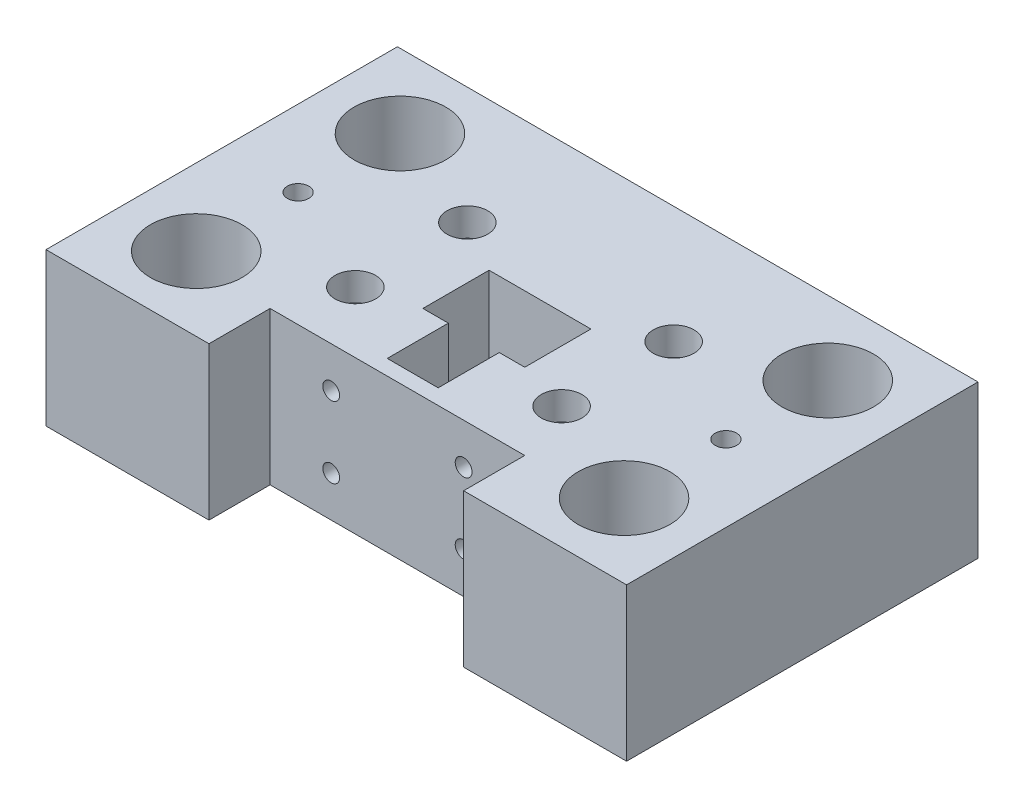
ISO-10303-21;
HEADER;
FILE_DESCRIPTION(('STEP AP214'),'2;1');
FILE_NAME('part.step','',(''),(''),'','','');
FILE_SCHEMA(('AUTOMOTIVE_DESIGN { 1 0 10303 214 1 1 1 1 }'));
ENDSEC;
DATA;
#1=APPLICATION_CONTEXT('core data for automotive mechanical design processes');
#2=APPLICATION_PROTOCOL_DEFINITION('international standard','automotive_design',2000,#1);
#3=PRODUCT_CONTEXT('',#1,'mechanical');
#4=PRODUCT('Part','Part','',(#3));
#5=PRODUCT_RELATED_PRODUCT_CATEGORY('part','',(#4));
#6=PRODUCT_DEFINITION_FORMATION('','',#4);
#7=PRODUCT_DEFINITION_CONTEXT('part definition',#1,'design');
#8=PRODUCT_DEFINITION('design','',#6,#7);
#9=PRODUCT_DEFINITION_SHAPE('','',#8);
#10=(LENGTH_UNIT() NAMED_UNIT(*) SI_UNIT(.MILLI.,.METRE.));
#11=(NAMED_UNIT(*) PLANE_ANGLE_UNIT() SI_UNIT($,.RADIAN.));
#12=(NAMED_UNIT(*) SI_UNIT($,.STERADIAN.) SOLID_ANGLE_UNIT());
#13=UNCERTAINTY_MEASURE_WITH_UNIT(LENGTH_MEASURE(1.E-05),#10,'distance_accuracy_value','');
#14=(GEOMETRIC_REPRESENTATION_CONTEXT(3) GLOBAL_UNCERTAINTY_ASSIGNED_CONTEXT((#13)) GLOBAL_UNIT_ASSIGNED_CONTEXT((#10,
#11,#12)) REPRESENTATION_CONTEXT('',''));
#15=CARTESIAN_POINT('',(0.,0.,0.));
#16=DIRECTION('',(0.,0.,1.));
#17=DIRECTION('',(1.,0.,0.));
#18=AXIS2_PLACEMENT_3D('',#15,#16,#17);
#19=CARTESIAN_POINT('',(36.7500000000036,-39.,23.0120402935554));
#20=DIRECTION('',(0.,1.,0.));
#21=DIRECTION('',(0.,0.,1.));
#22=AXIS2_PLACEMENT_3D('',#19,#20,#21);
#23=CYLINDRICAL_SURFACE('',#22,2.5);
#24=CARTESIAN_POINT('',(36.7500000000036,0.,23.0120402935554));
#25=DIRECTION('',(0.,1.,0.));
#26=DIRECTION('',(0.,0.,1.));
#27=AXIS2_PLACEMENT_3D('',#24,#25,#26);
#28=CIRCLE('',#27,2.5);
#29=CARTESIAN_POINT('',(36.7500000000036,0.,25.5120402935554));
#30=VERTEX_POINT('',#29);
#31=EDGE_CURVE('E208',#30,#30,#28,.T.);
#32=ORIENTED_EDGE('',*,*,#31,.F.);
#33=EDGE_LOOP('',(#32));
#34=FACE_BOUND('',#33,.T.);
#35=CARTESIAN_POINT('',(36.7500000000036,24.5,23.0120402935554));
#36=DIRECTION('',(0.,1.,0.));
#37=DIRECTION('',(0.,0.,1.));
#38=AXIS2_PLACEMENT_3D('',#35,#36,#37);
#39=CIRCLE('',#38,2.5);
#40=CARTESIAN_POINT('',(36.7500000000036,24.5,25.5120402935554));
#41=VERTEX_POINT('',#40);
#42=EDGE_CURVE('E37',#41,#41,#39,.F.);
#43=ORIENTED_EDGE('',*,*,#42,.F.);
#44=EDGE_LOOP('',(#43));
#45=FACE_BOUND('',#44,.T.);
#46=ADVANCED_FACE('F33',(#34,#45),#23,.F.);
#47=CARTESIAN_POINT('',(77.2500000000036,-39.,23.0120402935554));
#48=DIRECTION('',(0.,1.,0.));
#49=DIRECTION('',(0.,0.,1.));
#50=AXIS2_PLACEMENT_3D('',#47,#48,#49);
#51=CYLINDRICAL_SURFACE('',#50,2.5);
#52=CARTESIAN_POINT('',(77.2500000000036,0.,23.0120402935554));
#53=DIRECTION('',(0.,1.,0.));
#54=DIRECTION('',(0.,0.,1.));
#55=AXIS2_PLACEMENT_3D('',#52,#53,#54);
#56=CIRCLE('',#55,2.5);
#57=CARTESIAN_POINT('',(77.2500000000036,0.,25.5120402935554));
#58=VERTEX_POINT('',#57);
#59=EDGE_CURVE('E211',#58,#58,#56,.T.);
#60=ORIENTED_EDGE('',*,*,#59,.F.);
#61=EDGE_LOOP('',(#60));
#62=FACE_BOUND('',#61,.T.);
#63=CARTESIAN_POINT('',(77.2500000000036,24.5,23.0120402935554));
#64=DIRECTION('',(0.,1.,0.));
#65=DIRECTION('',(0.,0.,1.));
#66=AXIS2_PLACEMENT_3D('',#63,#64,#65);
#67=CIRCLE('',#66,2.5);
#68=CARTESIAN_POINT('',(77.2500000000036,24.5,25.5120402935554));
#69=VERTEX_POINT('',#68);
#70=EDGE_CURVE('E345',#69,#69,#67,.F.);
#71=ORIENTED_EDGE('',*,*,#70,.F.);
#72=EDGE_LOOP('',(#71));
#73=FACE_BOUND('',#72,.T.);
#74=ADVANCED_FACE('F435',(#62,#73),#51,.F.);
#75=CARTESIAN_POINT('',(77.2500000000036,-39.,45.0120402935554));
#76=DIRECTION('',(0.,1.,0.));
#77=DIRECTION('',(0.,0.,1.));
#78=AXIS2_PLACEMENT_3D('',#75,#76,#77);
#79=CYLINDRICAL_SURFACE('',#78,2.5);
#80=CARTESIAN_POINT('',(77.2500000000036,0.,45.0120402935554));
#81=DIRECTION('',(0.,1.,0.));
#82=DIRECTION('',(0.,0.,1.));
#83=AXIS2_PLACEMENT_3D('',#80,#81,#82);
#84=CIRCLE('',#83,2.5);
#85=CARTESIAN_POINT('',(77.2500000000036,0.,47.5120402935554));
#86=VERTEX_POINT('',#85);
#87=EDGE_CURVE('E214',#86,#86,#84,.T.);
#88=ORIENTED_EDGE('',*,*,#87,.F.);
#89=EDGE_LOOP('',(#88));
#90=FACE_BOUND('',#89,.T.);
#91=CARTESIAN_POINT('',(77.2500000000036,24.5,45.0120402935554));
#92=DIRECTION('',(0.,1.,0.));
#93=DIRECTION('',(0.,0.,1.));
#94=AXIS2_PLACEMENT_3D('',#91,#92,#93);
#95=CIRCLE('',#94,2.5);
#96=CARTESIAN_POINT('',(77.2500000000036,24.5,47.5120402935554));
#97=VERTEX_POINT('',#96);
#98=EDGE_CURVE('E342',#97,#97,#95,.F.);
#99=ORIENTED_EDGE('',*,*,#98,.F.);
#100=EDGE_LOOP('',(#99));
#101=FACE_BOUND('',#100,.T.);
#102=ADVANCED_FACE('F441',(#90,#101),#79,.F.);
#103=CARTESIAN_POINT('',(36.7500000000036,-39.,45.0120402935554));
#104=DIRECTION('',(0.,1.,0.));
#105=DIRECTION('',(0.,0.,1.));
#106=AXIS2_PLACEMENT_3D('',#103,#104,#105);
#107=CYLINDRICAL_SURFACE('',#106,2.5);
#108=CARTESIAN_POINT('',(36.7500000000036,0.,45.0120402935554));
#109=DIRECTION('',(0.,1.,0.));
#110=DIRECTION('',(0.,0.,1.));
#111=AXIS2_PLACEMENT_3D('',#108,#109,#110);
#112=CIRCLE('',#111,2.5);
#113=CARTESIAN_POINT('',(36.7500000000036,0.,47.5120402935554));
#114=VERTEX_POINT('',#113);
#115=EDGE_CURVE('E217',#114,#114,#112,.T.);
#116=ORIENTED_EDGE('',*,*,#115,.F.);
#117=EDGE_LOOP('',(#116));
#118=FACE_BOUND('',#117,.T.);
#119=CARTESIAN_POINT('',(36.7500000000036,24.5,45.0120402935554));
#120=DIRECTION('',(0.,1.,0.));
#121=DIRECTION('',(0.,0.,1.));
#122=AXIS2_PLACEMENT_3D('',#119,#120,#121);
#123=CIRCLE('',#122,2.5);
#124=CARTESIAN_POINT('',(36.7500000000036,24.5,47.5120402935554));
#125=VERTEX_POINT('',#124);
#126=EDGE_CURVE('E182',#125,#125,#123,.F.);
#127=ORIENTED_EDGE('',*,*,#126,.F.);
#128=EDGE_LOOP('',(#127));
#129=FACE_BOUND('',#128,.T.);
#130=ADVANCED_FACE('F449',(#118,#129),#107,.F.);
#131=CARTESIAN_POINT('',(52.,-39.,52.));
#132=DIRECTION('',(0.,0.,1.));
#133=DIRECTION('',(1.,0.,0.));
#134=AXIS2_PLACEMENT_3D('',#131,#132,#133);
#135=PLANE('',#134);
#136=DIRECTION('',(-1.,0.,0.));
#137=VECTOR('',#136,1.);
#138=CARTESIAN_POINT('',(52.,5.,52.));
#139=LINE('',#138,#137);
#140=CARTESIAN_POINT('',(62.,5.,52.));
#141=VERTEX_POINT('',#140);
#142=CARTESIAN_POINT('',(52.,5.,52.));
#143=VERTEX_POINT('',#142);
#144=EDGE_CURVE('E50',#141,#143,#139,.T.);
#145=ORIENTED_EDGE('',*,*,#144,.F.);
#146=DIRECTION('',(0.,1.,0.));
#147=VECTOR('',#146,1.);
#148=CARTESIAN_POINT('',(62.,-39.,52.));
#149=LINE('',#148,#147);
#150=CARTESIAN_POINT('',(62.,0.,52.));
#151=VERTEX_POINT('',#150);
#152=EDGE_CURVE('E248',#151,#141,#149,.T.);
#153=ORIENTED_EDGE('',*,*,#152,.F.);
#154=DIRECTION('',(1.,0.,0.));
#155=VECTOR('',#154,1.);
#156=CARTESIAN_POINT('',(0.,0.,52.));
#157=LINE('',#156,#155);
#158=CARTESIAN_POINT('',(52.,0.,52.));
#159=VERTEX_POINT('',#158);
#160=EDGE_CURVE('E262',#159,#151,#157,.T.);
#161=ORIENTED_EDGE('',*,*,#160,.F.);
#162=DIRECTION('',(0.,1.,0.));
#163=VECTOR('',#162,1.);
#164=CARTESIAN_POINT('',(52.,-39.,52.));
#165=LINE('',#164,#163);
#166=EDGE_CURVE('E251',#159,#143,#165,.T.);
#167=ORIENTED_EDGE('',*,*,#166,.T.);
#168=EDGE_LOOP('',(#145,#153,#161,#167));
#169=FACE_BOUND('',#168,.T.);
#170=ADVANCED_FACE('F453',(#169),#135,.F.);
#171=CARTESIAN_POINT('',(0.,0.,69.));
#172=DIRECTION('',(0.,1.,0.));
#173=DIRECTION('',(0.,0.,1.));
#174=AXIS2_PLACEMENT_3D('',#171,#172,#173);
#175=PLANE('',#174);
#176=CARTESIAN_POINT('',(72.,0.,35.5));
#177=DIRECTION('',(0.,-1.,0.));
#178=DIRECTION('',(0.,0.,-1.));
#179=AXIS2_PLACEMENT_3D('',#176,#177,#178);
#180=CIRCLE('',#179,1.65);
#181=CARTESIAN_POINT('',(72.,0.,33.85));
#182=VERTEX_POINT('',#181);
#183=EDGE_CURVE('E511',#182,#182,#180,.T.);
#184=ORIENTED_EDGE('',*,*,#183,.F.);
#185=EDGE_LOOP('',(#184));
#186=FACE_BOUND('',#185,.T.);
#187=CARTESIAN_POINT('',(42.,0.,35.5));
#188=DIRECTION('',(0.,-1.,0.));
#189=DIRECTION('',(0.,0.,-1.));
#190=AXIS2_PLACEMENT_3D('',#187,#188,#189);
#191=CIRCLE('',#190,1.65);
#192=CARTESIAN_POINT('',(42.,0.,33.85));
#193=VERTEX_POINT('',#192);
#194=EDGE_CURVE('E515',#193,#193,#191,.T.);
#195=ORIENTED_EDGE('',*,*,#194,.F.);
#196=EDGE_LOOP('',(#195));
#197=FACE_BOUND('',#196,.T.);
#198=CARTESIAN_POINT('',(15.,0.,14.5));
#199=DIRECTION('',(0.,1.,0.));
#200=DIRECTION('',(0.,0.,1.));
#201=AXIS2_PLACEMENT_3D('',#198,#199,#200);
#202=CIRCLE('',#201,9.);
#203=CARTESIAN_POINT('',(15.,0.,23.5));
#204=VERTEX_POINT('',#203);
#205=EDGE_CURVE('E301',#204,#204,#202,.T.);
#206=ORIENTED_EDGE('',*,*,#205,.T.);
#207=EDGE_LOOP('',(#206));
#208=FACE_BOUND('',#207,.T.);
#209=CARTESIAN_POINT('',(99.,0.,14.5));
#210=DIRECTION('',(0.,1.,0.));
#211=DIRECTION('',(0.,0.,1.));
#212=AXIS2_PLACEMENT_3D('',#209,#210,#211);
#213=CIRCLE('',#212,9.00000000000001);
#214=CARTESIAN_POINT('',(99.,0.,23.5));
#215=VERTEX_POINT('',#214);
#216=EDGE_CURVE('E295',#215,#215,#213,.T.);
#217=ORIENTED_EDGE('',*,*,#216,.T.);
#218=EDGE_LOOP('',(#217));
#219=FACE_BOUND('',#218,.T.);
#220=CARTESIAN_POINT('',(99.,0.,54.5));
#221=DIRECTION('',(0.,1.,0.));
#222=DIRECTION('',(0.,0.,1.));
#223=AXIS2_PLACEMENT_3D('',#220,#221,#222);
#224=CIRCLE('',#223,9.00000000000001);
#225=CARTESIAN_POINT('',(99.,0.,63.5));
#226=VERTEX_POINT('',#225);
#227=EDGE_CURVE('E289',#226,#226,#224,.T.);
#228=ORIENTED_EDGE('',*,*,#227,.T.);
#229=EDGE_LOOP('',(#228));
#230=FACE_BOUND('',#229,.T.);
#231=CARTESIAN_POINT('',(15.,0.,54.5));
#232=DIRECTION('',(0.,1.,0.));
#233=DIRECTION('',(0.,0.,1.));
#234=AXIS2_PLACEMENT_3D('',#231,#232,#233);
#235=CIRCLE('',#234,9.);
#236=CARTESIAN_POINT('',(15.,0.,63.5));
#237=VERTEX_POINT('',#236);
#238=EDGE_CURVE('E283',#237,#237,#235,.T.);
#239=ORIENTED_EDGE('',*,*,#238,.T.);
#240=EDGE_LOOP('',(#239));
#241=FACE_BOUND('',#240,.T.);
#242=DIRECTION('',(-1.,0.,0.));
#243=VECTOR('',#242,1.);
#244=CARTESIAN_POINT('',(0.,0.,29.));
#245=LINE('',#244,#243);
#246=CARTESIAN_POINT('',(67.,0.,29.));
#247=VERTEX_POINT('',#246);
#248=CARTESIAN_POINT('',(47.,0.,29.));
#249=VERTEX_POINT('',#248);
#250=EDGE_CURVE('E274',#247,#249,#245,.T.);
#251=ORIENTED_EDGE('',*,*,#250,.T.);
#252=DIRECTION('',(0.,0.,1.));
#253=VECTOR('',#252,1.);
#254=CARTESIAN_POINT('',(47.,0.,69.));
#255=LINE('',#254,#253);
#256=CARTESIAN_POINT('',(47.,0.,42.));
#257=VERTEX_POINT('',#256);
#258=EDGE_CURVE('E277',#249,#257,#255,.T.);
#259=ORIENTED_EDGE('',*,*,#258,.T.);
#260=DIRECTION('',(1.,0.,0.));
#261=VECTOR('',#260,1.);
#262=CARTESIAN_POINT('',(0.,0.,42.));
#263=LINE('',#262,#261);
#264=CARTESIAN_POINT('',(52.,0.,42.));
#265=VERTEX_POINT('',#264);
#266=EDGE_CURVE('E241',#257,#265,#263,.T.);
#267=ORIENTED_EDGE('',*,*,#266,.T.);
#268=DIRECTION('',(0.,0.,1.));
#269=VECTOR('',#268,1.);
#270=CARTESIAN_POINT('',(52.,0.,69.));
#271=LINE('',#270,#269);
#272=EDGE_CURVE('E259',#265,#159,#271,.T.);
#273=ORIENTED_EDGE('',*,*,#272,.T.);
#274=ORIENTED_EDGE('',*,*,#160,.T.);
#275=DIRECTION('',(0.,0.,-1.));
#276=VECTOR('',#275,1.);
#277=CARTESIAN_POINT('',(62.,0.,69.));
#278=LINE('',#277,#276);
#279=CARTESIAN_POINT('',(62.,0.,42.));
#280=VERTEX_POINT('',#279);
#281=EDGE_CURVE('E265',#151,#280,#278,.T.);
#282=ORIENTED_EDGE('',*,*,#281,.T.);
#283=DIRECTION('',(1.,0.,0.));
#284=VECTOR('',#283,1.);
#285=CARTESIAN_POINT('',(0.,0.,42.));
#286=LINE('',#285,#284);
#287=CARTESIAN_POINT('',(67.,0.,42.));
#288=VERTEX_POINT('',#287);
#289=EDGE_CURVE('E268',#280,#288,#286,.T.);
#290=ORIENTED_EDGE('',*,*,#289,.T.);
#291=DIRECTION('',(0.,0.,-1.));
#292=VECTOR('',#291,1.);
#293=CARTESIAN_POINT('',(67.,0.,69.));
#294=LINE('',#293,#292);
#295=EDGE_CURVE('E271',#288,#247,#294,.T.);
#296=ORIENTED_EDGE('',*,*,#295,.T.);
#297=EDGE_LOOP('',(#251,#259,#267,#273,#274,#282,#290,#296));
#298=FACE_BOUND('',#297,.T.);
#299=ORIENTED_EDGE('',*,*,#115,.T.);
#300=EDGE_LOOP('',(#299));
#301=FACE_BOUND('',#300,.T.);
#302=ORIENTED_EDGE('',*,*,#87,.T.);
#303=EDGE_LOOP('',(#302));
#304=FACE_BOUND('',#303,.T.);
#305=ORIENTED_EDGE('',*,*,#59,.T.);
#306=EDGE_LOOP('',(#305));
#307=FACE_BOUND('',#306,.T.);
#308=ORIENTED_EDGE('',*,*,#31,.T.);
#309=EDGE_LOOP('',(#308));
#310=FACE_BOUND('',#309,.T.);
#311=DIRECTION('',(0.,0.,1.));
#312=VECTOR('',#311,1.);
#313=CARTESIAN_POINT('',(82.,0.,69.));
#314=LINE('',#313,#312);
#315=CARTESIAN_POINT('',(82.,0.,57.));
#316=VERTEX_POINT('',#315);
#317=CARTESIAN_POINT('',(82.,0.,69.));
#318=VERTEX_POINT('',#317);
#319=EDGE_CURVE('E204',#316,#318,#314,.T.);
#320=ORIENTED_EDGE('',*,*,#319,.F.);
#321=DIRECTION('',(1.,0.,0.));
#322=VECTOR('',#321,1.);
#323=CARTESIAN_POINT('',(0.,0.,57.));
#324=LINE('',#323,#322);
#325=CARTESIAN_POINT('',(32.,0.,57.));
#326=VERTEX_POINT('',#325);
#327=EDGE_CURVE('E206',#326,#316,#324,.T.);
#328=ORIENTED_EDGE('',*,*,#327,.F.);
#329=DIRECTION('',(0.,0.,-1.));
#330=VECTOR('',#329,1.);
#331=CARTESIAN_POINT('',(32.,0.,69.));
#332=LINE('',#331,#330);
#333=CARTESIAN_POINT('',(32.,0.,69.));
#334=VERTEX_POINT('',#333);
#335=EDGE_CURVE('E201',#334,#326,#332,.T.);
#336=ORIENTED_EDGE('',*,*,#335,.F.);
#337=DIRECTION('',(1.,0.,0.));
#338=VECTOR('',#337,1.);
#339=CARTESIAN_POINT('',(0.,0.,69.));
#340=LINE('',#339,#338);
#341=CARTESIAN_POINT('',(0.,0.,69.));
#342=VERTEX_POINT('',#341);
#343=EDGE_CURVE('E310',#342,#334,#340,.T.);
#344=ORIENTED_EDGE('',*,*,#343,.F.);
#345=DIRECTION('',(0.,0.,-1.));
#346=VECTOR('',#345,1.);
#347=CARTESIAN_POINT('',(0.,0.,69.));
#348=LINE('',#347,#346);
#349=CARTESIAN_POINT('',(0.,0.,0.));
#350=VERTEX_POINT('',#349);
#351=EDGE_CURVE('E335',#342,#350,#348,.T.);
#352=ORIENTED_EDGE('',*,*,#351,.T.);
#353=DIRECTION('',(1.,0.,0.));
#354=VECTOR('',#353,1.);
#355=CARTESIAN_POINT('',(0.,0.,0.));
#356=LINE('',#355,#354);
#357=CARTESIAN_POINT('',(114.,0.,0.));
#358=VERTEX_POINT('',#357);
#359=EDGE_CURVE('E322',#350,#358,#356,.T.);
#360=ORIENTED_EDGE('',*,*,#359,.T.);
#361=DIRECTION('',(0.,0.,-1.));
#362=VECTOR('',#361,1.);
#363=CARTESIAN_POINT('',(114.,0.,69.));
#364=LINE('',#363,#362);
#365=CARTESIAN_POINT('',(114.,0.,69.));
#366=VERTEX_POINT('',#365);
#367=EDGE_CURVE('E332',#366,#358,#364,.T.);
#368=ORIENTED_EDGE('',*,*,#367,.F.);
#369=EDGE_CURVE('E308',#318,#366,#340,.T.);
#370=ORIENTED_EDGE('',*,*,#369,.F.);
#371=EDGE_LOOP('',(#320,#328,#336,#344,#352,#360,#368,#370));
#372=FACE_BOUND('',#371,.T.);
#373=ADVANCED_FACE('F377',(#186,#197,#208,#219,#230,#241,#298,#301,#304,#307,#310,#372),#175,.F.);
#374=CARTESIAN_POINT('',(0.,30.,69.));
#375=DIRECTION('',(0.,-1.,0.));
#376=DIRECTION('',(0.,0.,-1.));
#377=AXIS2_PLACEMENT_3D('',#374,#375,#376);
#378=PLANE('',#377);
#379=CARTESIAN_POINT('',(99.,30.,34.5));
#380=DIRECTION('',(0.,1.,0.));
#381=DIRECTION('',(0.,0.,1.));
#382=AXIS2_PLACEMENT_3D('',#379,#380,#381);
#383=CIRCLE('',#382,2.1);
#384=CARTESIAN_POINT('',(99.,30.,36.6));
#385=VERTEX_POINT('',#384);
#386=EDGE_CURVE('E838',#385,#385,#383,.T.);
#387=ORIENTED_EDGE('',*,*,#386,.F.);
#388=EDGE_LOOP('',(#387));
#389=FACE_BOUND('',#388,.T.);
#390=CARTESIAN_POINT('',(15.,30.,34.5));
#391=DIRECTION('',(0.,1.,0.));
#392=DIRECTION('',(0.,0.,1.));
#393=AXIS2_PLACEMENT_3D('',#390,#391,#392);
#394=CIRCLE('',#393,2.1);
#395=CARTESIAN_POINT('',(15.,30.,36.6));
#396=VERTEX_POINT('',#395);
#397=EDGE_CURVE('E843',#396,#396,#394,.T.);
#398=ORIENTED_EDGE('',*,*,#397,.F.);
#399=EDGE_LOOP('',(#398));
#400=FACE_BOUND('',#399,.T.);
#401=CARTESIAN_POINT('',(36.7500000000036,30.,23.0120402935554));
#402=DIRECTION('',(0.,1.,0.));
#403=DIRECTION('',(0.,0.,1.));
#404=AXIS2_PLACEMENT_3D('',#401,#402,#403);
#405=CIRCLE('',#404,4.);
#406=CARTESIAN_POINT('',(36.7500000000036,30.,27.0120402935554));
#407=VERTEX_POINT('',#406);
#408=EDGE_CURVE('E361',#407,#407,#405,.T.);
#409=ORIENTED_EDGE('',*,*,#408,.F.);
#410=EDGE_LOOP('',(#409));
#411=FACE_BOUND('',#410,.T.);
#412=CARTESIAN_POINT('',(77.2500000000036,30.,23.0120402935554));
#413=DIRECTION('',(0.,1.,0.));
#414=DIRECTION('',(0.,0.,1.));
#415=AXIS2_PLACEMENT_3D('',#412,#413,#414);
#416=CIRCLE('',#415,4.);
#417=CARTESIAN_POINT('',(77.2500000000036,30.,27.0120402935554));
#418=VERTEX_POINT('',#417);
#419=EDGE_CURVE('E354',#418,#418,#416,.T.);
#420=ORIENTED_EDGE('',*,*,#419,.F.);
#421=EDGE_LOOP('',(#420));
#422=FACE_BOUND('',#421,.T.);
#423=CARTESIAN_POINT('',(77.2500000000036,30.,45.0120402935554));
#424=DIRECTION('',(0.,1.,0.));
#425=DIRECTION('',(0.,0.,1.));
#426=AXIS2_PLACEMENT_3D('',#423,#424,#425);
#427=CIRCLE('',#426,4.);
#428=CARTESIAN_POINT('',(77.2500000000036,30.,49.0120402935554));
#429=VERTEX_POINT('',#428);
#430=EDGE_CURVE('E347',#429,#429,#427,.T.);
#431=ORIENTED_EDGE('',*,*,#430,.F.);
#432=EDGE_LOOP('',(#431));
#433=FACE_BOUND('',#432,.T.);
#434=CARTESIAN_POINT('',(36.7500000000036,30.,45.0120402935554));
#435=DIRECTION('',(0.,1.,0.));
#436=DIRECTION('',(0.,0.,1.));
#437=AXIS2_PLACEMENT_3D('',#434,#435,#436);
#438=CIRCLE('',#437,4.);
#439=CARTESIAN_POINT('',(36.7500000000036,30.,49.0120402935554));
#440=VERTEX_POINT('',#439);
#441=EDGE_CURVE('E185',#440,#440,#438,.T.);
#442=ORIENTED_EDGE('',*,*,#441,.F.);
#443=EDGE_LOOP('',(#442));
#444=FACE_BOUND('',#443,.T.);
#445=CARTESIAN_POINT('',(15.,30.,14.5));
#446=DIRECTION('',(0.,1.,0.));
#447=DIRECTION('',(0.,0.,1.));
#448=AXIS2_PLACEMENT_3D('',#445,#446,#447);
#449=CIRCLE('',#448,9.);
#450=CARTESIAN_POINT('',(15.,30.,23.5));
#451=VERTEX_POINT('',#450);
#452=EDGE_CURVE('E298',#451,#451,#449,.T.);
#453=ORIENTED_EDGE('',*,*,#452,.F.);
#454=EDGE_LOOP('',(#453));
#455=FACE_BOUND('',#454,.T.);
#456=CARTESIAN_POINT('',(99.,30.,14.5));
#457=DIRECTION('',(0.,1.,0.));
#458=DIRECTION('',(0.,0.,1.));
#459=AXIS2_PLACEMENT_3D('',#456,#457,#458);
#460=CIRCLE('',#459,9.00000000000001);
#461=CARTESIAN_POINT('',(99.,30.,23.5));
#462=VERTEX_POINT('',#461);
#463=EDGE_CURVE('E292',#462,#462,#460,.T.);
#464=ORIENTED_EDGE('',*,*,#463,.F.);
#465=EDGE_LOOP('',(#464));
#466=FACE_BOUND('',#465,.T.);
#467=CARTESIAN_POINT('',(99.,30.,54.5));
#468=DIRECTION('',(0.,1.,0.));
#469=DIRECTION('',(0.,0.,1.));
#470=AXIS2_PLACEMENT_3D('',#467,#468,#469);
#471=CIRCLE('',#470,9.00000000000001);
#472=CARTESIAN_POINT('',(99.,30.,63.5));
#473=VERTEX_POINT('',#472);
#474=EDGE_CURVE('E286',#473,#473,#471,.T.);
#475=ORIENTED_EDGE('',*,*,#474,.F.);
#476=EDGE_LOOP('',(#475));
#477=FACE_BOUND('',#476,.T.);
#478=CARTESIAN_POINT('',(15.,30.,54.5));
#479=DIRECTION('',(0.,1.,0.));
#480=DIRECTION('',(0.,0.,1.));
#481=AXIS2_PLACEMENT_3D('',#478,#479,#480);
#482=CIRCLE('',#481,9.);
#483=CARTESIAN_POINT('',(15.,30.,63.5));
#484=VERTEX_POINT('',#483);
#485=EDGE_CURVE('E280',#484,#484,#482,.T.);
#486=ORIENTED_EDGE('',*,*,#485,.F.);
#487=EDGE_LOOP('',(#486));
#488=FACE_BOUND('',#487,.T.);
#489=DIRECTION('',(1.,0.,0.));
#490=VECTOR('',#489,1.);
#491=CARTESIAN_POINT('',(52.,30.,54.));
#492=LINE('',#491,#490);
#493=CARTESIAN_POINT('',(52.,30.,54.));
#494=VERTEX_POINT('',#493);
#495=CARTESIAN_POINT('',(62.,30.,54.));
#496=VERTEX_POINT('',#495);
#497=EDGE_CURVE('E180',#494,#496,#492,.T.);
#498=ORIENTED_EDGE('',*,*,#497,.F.);
#499=DIRECTION('',(0.,0.,1.));
#500=VECTOR('',#499,1.);
#501=CARTESIAN_POINT('',(52.,30.,52.));
#502=LINE('',#501,#500);
#503=CARTESIAN_POINT('',(52.,30.,42.));
#504=VERTEX_POINT('',#503);
#505=EDGE_CURVE('E166',#504,#494,#502,.T.);
#506=ORIENTED_EDGE('',*,*,#505,.F.);
#507=DIRECTION('',(1.,0.,0.));
#508=VECTOR('',#507,1.);
#509=CARTESIAN_POINT('',(47.,30.,42.));
#510=LINE('',#509,#508);
#511=CARTESIAN_POINT('',(47.,30.,42.));
#512=VERTEX_POINT('',#511);
#513=EDGE_CURVE('E222',#512,#504,#510,.T.);
#514=ORIENTED_EDGE('',*,*,#513,.F.);
#515=DIRECTION('',(0.,0.,1.));
#516=VECTOR('',#515,1.);
#517=CARTESIAN_POINT('',(47.,30.,42.));
#518=LINE('',#517,#516);
#519=CARTESIAN_POINT('',(47.,30.,29.));
#520=VERTEX_POINT('',#519);
#521=EDGE_CURVE('E220',#520,#512,#518,.T.);
#522=ORIENTED_EDGE('',*,*,#521,.F.);
#523=DIRECTION('',(-1.,0.,0.));
#524=VECTOR('',#523,1.);
#525=CARTESIAN_POINT('',(47.,30.,29.));
#526=LINE('',#525,#524);
#527=CARTESIAN_POINT('',(67.,30.,29.));
#528=VERTEX_POINT('',#527);
#529=EDGE_CURVE('E235',#528,#520,#526,.T.);
#530=ORIENTED_EDGE('',*,*,#529,.F.);
#531=DIRECTION('',(0.,0.,-1.));
#532=VECTOR('',#531,1.);
#533=CARTESIAN_POINT('',(67.,30.,42.));
#534=LINE('',#533,#532);
#535=CARTESIAN_POINT('',(67.,30.,42.));
#536=VERTEX_POINT('',#535);
#537=EDGE_CURVE('E232',#536,#528,#534,.T.);
#538=ORIENTED_EDGE('',*,*,#537,.F.);
#539=DIRECTION('',(1.,0.,0.));
#540=VECTOR('',#539,1.);
#541=CARTESIAN_POINT('',(62.,30.,42.));
#542=LINE('',#541,#540);
#543=CARTESIAN_POINT('',(62.,30.,42.));
#544=VERTEX_POINT('',#543);
#545=EDGE_CURVE('E229',#544,#536,#542,.T.);
#546=ORIENTED_EDGE('',*,*,#545,.F.);
#547=DIRECTION('',(0.,0.,-1.));
#548=VECTOR('',#547,1.);
#549=CARTESIAN_POINT('',(62.,30.,52.));
#550=LINE('',#549,#548);
#551=EDGE_CURVE('E226',#496,#544,#550,.T.);
#552=ORIENTED_EDGE('',*,*,#551,.F.);
#553=EDGE_LOOP('',(#498,#506,#514,#522,#530,#538,#546,#552));
#554=FACE_BOUND('',#553,.T.);
#555=DIRECTION('',(0.,0.,1.));
#556=VECTOR('',#555,1.);
#557=CARTESIAN_POINT('',(82.,30.,69.));
#558=LINE('',#557,#556);
#559=CARTESIAN_POINT('',(82.,30.,57.));
#560=VERTEX_POINT('',#559);
#561=CARTESIAN_POINT('',(82.,30.,69.));
#562=VERTEX_POINT('',#561);
#563=EDGE_CURVE('E195',#560,#562,#558,.T.);
#564=ORIENTED_EDGE('',*,*,#563,.T.);
#565=DIRECTION('',(-1.,0.,0.));
#566=VECTOR('',#565,1.);
#567=CARTESIAN_POINT('',(0.,30.,69.));
#568=LINE('',#567,#566);
#569=CARTESIAN_POINT('',(114.,30.,69.));
#570=VERTEX_POINT('',#569);
#571=EDGE_CURVE('E316',#570,#562,#568,.T.);
#572=ORIENTED_EDGE('',*,*,#571,.F.);
#573=DIRECTION('',(0.,0.,-1.));
#574=VECTOR('',#573,1.);
#575=CARTESIAN_POINT('',(114.,30.,69.));
#576=LINE('',#575,#574);
#577=CARTESIAN_POINT('',(114.,30.,0.));
#578=VERTEX_POINT('',#577);
#579=EDGE_CURVE('E329',#570,#578,#576,.T.);
#580=ORIENTED_EDGE('',*,*,#579,.T.);
#581=DIRECTION('',(-1.,0.,0.));
#582=VECTOR('',#581,1.);
#583=CARTESIAN_POINT('',(0.,30.,0.));
#584=LINE('',#583,#582);
#585=CARTESIAN_POINT('',(0.,30.,0.));
#586=VERTEX_POINT('',#585);
#587=EDGE_CURVE('E309',#578,#586,#584,.T.);
#588=ORIENTED_EDGE('',*,*,#587,.T.);
#589=DIRECTION('',(0.,0.,-1.));
#590=VECTOR('',#589,1.);
#591=CARTESIAN_POINT('',(0.,30.,69.));
#592=LINE('',#591,#590);
#593=CARTESIAN_POINT('',(0.,30.,69.));
#594=VERTEX_POINT('',#593);
#595=EDGE_CURVE('E319',#594,#586,#592,.T.);
#596=ORIENTED_EDGE('',*,*,#595,.F.);
#597=CARTESIAN_POINT('',(32.,30.,69.));
#598=VERTEX_POINT('',#597);
#599=EDGE_CURVE('E315',#598,#594,#568,.T.);
#600=ORIENTED_EDGE('',*,*,#599,.F.);
#601=DIRECTION('',(0.,0.,-1.));
#602=VECTOR('',#601,1.);
#603=CARTESIAN_POINT('',(32.,30.,69.));
#604=LINE('',#603,#602);
#605=CARTESIAN_POINT('',(32.,30.,57.));
#606=VERTEX_POINT('',#605);
#607=EDGE_CURVE('E58',#598,#606,#604,.T.);
#608=ORIENTED_EDGE('',*,*,#607,.T.);
#609=DIRECTION('',(1.,0.,0.));
#610=VECTOR('',#609,1.);
#611=CARTESIAN_POINT('',(32.,30.,57.));
#612=LINE('',#611,#610);
#613=EDGE_CURVE('E192',#606,#560,#612,.T.);
#614=ORIENTED_EDGE('',*,*,#613,.T.);
#615=EDGE_LOOP('',(#564,#572,#580,#588,#596,#600,#608,#614));
#616=FACE_BOUND('',#615,.T.);
#617=ADVANCED_FACE('F373',(#389,#400,#411,#422,#433,#444,#455,#466,#477,#488,#554,#616),#378,.F.);
#618=CARTESIAN_POINT('',(0.,30.,69.));
#619=DIRECTION('',(0.,0.,-1.));
#620=DIRECTION('',(-1.,0.,0.));
#621=AXIS2_PLACEMENT_3D('',#618,#619,#620);
#622=PLANE('',#621);
#623=DIRECTION('',(0.,1.,0.));
#624=VECTOR('',#623,1.);
#625=CARTESIAN_POINT('',(82.,30.,69.));
#626=LINE('',#625,#624);
#627=EDGE_CURVE('E12',#318,#562,#626,.T.);
#628=ORIENTED_EDGE('',*,*,#627,.F.);
#629=ORIENTED_EDGE('',*,*,#369,.T.);
#630=DIRECTION('',(0.,1.,0.));
#631=VECTOR('',#630,1.);
#632=CARTESIAN_POINT('',(114.,0.,69.));
#633=LINE('',#632,#631);
#634=EDGE_CURVE('E313',#366,#570,#633,.T.);
#635=ORIENTED_EDGE('',*,*,#634,.T.);
#636=ORIENTED_EDGE('',*,*,#571,.T.);
#637=EDGE_LOOP('',(#628,#629,#635,#636));
#638=FACE_BOUND('',#637,.T.);
#639=ADVANCED_FACE('F376',(#638),#622,.F.);
#640=DIRECTION('',(0.,-1.,0.));
#641=VECTOR('',#640,1.);
#642=CARTESIAN_POINT('',(32.,30.,69.));
#643=LINE('',#642,#641);
#644=EDGE_CURVE('E42',#598,#334,#643,.T.);
#645=ORIENTED_EDGE('',*,*,#644,.F.);
#646=ORIENTED_EDGE('',*,*,#599,.T.);
#647=DIRECTION('',(0.,-1.,0.));
#648=VECTOR('',#647,1.);
#649=CARTESIAN_POINT('',(0.,0.,69.));
#650=LINE('',#649,#648);
#651=EDGE_CURVE('E305',#594,#342,#650,.T.);
#652=ORIENTED_EDGE('',*,*,#651,.T.);
#653=ORIENTED_EDGE('',*,*,#343,.T.);
#654=EDGE_LOOP('',(#645,#646,#652,#653));
#655=FACE_BOUND('',#654,.T.);
#656=ADVANCED_FACE('F413',(#655),#622,.F.);
#657=CARTESIAN_POINT('',(0.,0.,69.));
#658=DIRECTION('',(1.,0.,0.));
#659=DIRECTION('',(0.,0.,-1.));
#660=AXIS2_PLACEMENT_3D('',#657,#658,#659);
#661=PLANE('',#660);
#662=DIRECTION('',(0.,-1.,0.));
#663=VECTOR('',#662,1.);
#664=CARTESIAN_POINT('',(0.,0.,0.));
#665=LINE('',#664,#663);
#666=EDGE_CURVE('E304',#586,#350,#665,.T.);
#667=ORIENTED_EDGE('',*,*,#666,.T.);
#668=ORIENTED_EDGE('',*,*,#351,.F.);
#669=ORIENTED_EDGE('',*,*,#651,.F.);
#670=ORIENTED_EDGE('',*,*,#595,.T.);
#671=EDGE_LOOP('',(#667,#668,#669,#670));
#672=FACE_BOUND('',#671,.T.);
#673=ADVANCED_FACE('F35',(#672),#661,.F.);
#674=CARTESIAN_POINT('',(114.,0.,69.));
#675=DIRECTION('',(-1.,0.,0.));
#676=DIRECTION('',(0.,0.,1.));
#677=AXIS2_PLACEMENT_3D('',#674,#675,#676);
#678=PLANE('',#677);
#679=DIRECTION('',(0.,1.,0.));
#680=VECTOR('',#679,1.);
#681=CARTESIAN_POINT('',(114.,0.,0.));
#682=LINE('',#681,#680);
#683=EDGE_CURVE('E324',#358,#578,#682,.T.);
#684=ORIENTED_EDGE('',*,*,#683,.T.);
#685=ORIENTED_EDGE('',*,*,#579,.F.);
#686=ORIENTED_EDGE('',*,*,#634,.F.);
#687=ORIENTED_EDGE('',*,*,#367,.T.);
#688=EDGE_LOOP('',(#684,#685,#686,#687));
#689=FACE_BOUND('',#688,.T.);
#690=ADVANCED_FACE('F401',(#689),#678,.F.);
#691=CARTESIAN_POINT('',(0.,30.,0.));
#692=DIRECTION('',(0.,0.,-1.));
#693=DIRECTION('',(-1.,0.,0.));
#694=AXIS2_PLACEMENT_3D('',#691,#692,#693);
#695=PLANE('',#694);
#696=ORIENTED_EDGE('',*,*,#666,.F.);
#697=ORIENTED_EDGE('',*,*,#587,.F.);
#698=ORIENTED_EDGE('',*,*,#683,.F.);
#699=ORIENTED_EDGE('',*,*,#359,.F.);
#700=EDGE_LOOP('',(#696,#697,#698,#699));
#701=FACE_BOUND('',#700,.T.);
#702=ADVANCED_FACE('F407',(#701),#695,.T.);
#703=CARTESIAN_POINT('',(15.,-39.,14.5));
#704=DIRECTION('',(0.,1.,0.));
#705=DIRECTION('',(0.,0.,1.));
#706=AXIS2_PLACEMENT_3D('',#703,#704,#705);
#707=CYLINDRICAL_SURFACE('',#706,9.);
#708=ORIENTED_EDGE('',*,*,#452,.T.);
#709=EDGE_LOOP('',(#708));
#710=FACE_BOUND('',#709,.T.);
#711=ORIENTED_EDGE('',*,*,#205,.F.);
#712=EDGE_LOOP('',(#711));
#713=FACE_BOUND('',#712,.T.);
#714=ADVANCED_FACE('F494',(#710,#713),#707,.F.);
#715=CARTESIAN_POINT('',(99.,-39.,14.5));
#716=DIRECTION('',(0.,1.,0.));
#717=DIRECTION('',(0.,0.,1.));
#718=AXIS2_PLACEMENT_3D('',#715,#716,#717);
#719=CYLINDRICAL_SURFACE('',#718,9.00000000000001);
#720=ORIENTED_EDGE('',*,*,#463,.T.);
#721=EDGE_LOOP('',(#720));
#722=FACE_BOUND('',#721,.T.);
#723=ORIENTED_EDGE('',*,*,#216,.F.);
#724=EDGE_LOOP('',(#723));
#725=FACE_BOUND('',#724,.T.);
#726=ADVANCED_FACE('F490',(#722,#725),#719,.F.);
#727=CARTESIAN_POINT('',(99.,-39.,54.5));
#728=DIRECTION('',(0.,1.,0.));
#729=DIRECTION('',(0.,0.,1.));
#730=AXIS2_PLACEMENT_3D('',#727,#728,#729);
#731=CYLINDRICAL_SURFACE('',#730,9.00000000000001);
#732=ORIENTED_EDGE('',*,*,#474,.T.);
#733=EDGE_LOOP('',(#732));
#734=FACE_BOUND('',#733,.T.);
#735=ORIENTED_EDGE('',*,*,#227,.F.);
#736=EDGE_LOOP('',(#735));
#737=FACE_BOUND('',#736,.T.);
#738=ADVANCED_FACE('F486',(#734,#737),#731,.F.);
#739=CARTESIAN_POINT('',(15.,-39.,54.5));
#740=DIRECTION('',(0.,1.,0.));
#741=DIRECTION('',(0.,0.,1.));
#742=AXIS2_PLACEMENT_3D('',#739,#740,#741);
#743=CYLINDRICAL_SURFACE('',#742,9.);
#744=ORIENTED_EDGE('',*,*,#485,.T.);
#745=EDGE_LOOP('',(#744));
#746=FACE_BOUND('',#745,.T.);
#747=ORIENTED_EDGE('',*,*,#238,.F.);
#748=EDGE_LOOP('',(#747));
#749=FACE_BOUND('',#748,.T.);
#750=ADVANCED_FACE('F482',(#746,#749),#743,.F.);
#751=CARTESIAN_POINT('',(47.,-39.,42.));
#752=DIRECTION('',(-1.,0.,0.));
#753=DIRECTION('',(0.,0.,1.));
#754=AXIS2_PLACEMENT_3D('',#751,#752,#753);
#755=PLANE('',#754);
#756=DIRECTION('',(0.,1.,0.));
#757=VECTOR('',#756,1.);
#758=CARTESIAN_POINT('',(47.,-39.,29.));
#759=LINE('',#758,#757);
#760=EDGE_CURVE('E239',#249,#520,#759,.T.);
#761=ORIENTED_EDGE('',*,*,#760,.T.);
#762=ORIENTED_EDGE('',*,*,#521,.T.);
#763=DIRECTION('',(0.,1.,0.));
#764=VECTOR('',#763,1.);
#765=CARTESIAN_POINT('',(47.,-39.,42.));
#766=LINE('',#765,#764);
#767=EDGE_CURVE('E238',#257,#512,#766,.T.);
#768=ORIENTED_EDGE('',*,*,#767,.F.);
#769=ORIENTED_EDGE('',*,*,#258,.F.);
#770=EDGE_LOOP('',(#761,#762,#768,#769));
#771=FACE_BOUND('',#770,.T.);
#772=ADVANCED_FACE('F459',(#771),#755,.F.);
#773=CARTESIAN_POINT('',(47.,-39.,29.));
#774=DIRECTION('',(0.,0.,-1.));
#775=DIRECTION('',(-1.,0.,0.));
#776=AXIS2_PLACEMENT_3D('',#773,#774,#775);
#777=PLANE('',#776);
#778=DIRECTION('',(0.,1.,0.));
#779=VECTOR('',#778,1.);
#780=CARTESIAN_POINT('',(67.,-39.,29.));
#781=LINE('',#780,#779);
#782=EDGE_CURVE('E242',#247,#528,#781,.T.);
#783=ORIENTED_EDGE('',*,*,#782,.T.);
#784=ORIENTED_EDGE('',*,*,#529,.T.);
#785=ORIENTED_EDGE('',*,*,#760,.F.);
#786=ORIENTED_EDGE('',*,*,#250,.F.);
#787=EDGE_LOOP('',(#783,#784,#785,#786));
#788=FACE_BOUND('',#787,.T.);
#789=ADVANCED_FACE('F455',(#788),#777,.F.);
#790=CARTESIAN_POINT('',(67.,-39.,42.));
#791=DIRECTION('',(1.,0.,0.));
#792=DIRECTION('',(0.,0.,-1.));
#793=AXIS2_PLACEMENT_3D('',#790,#791,#792);
#794=PLANE('',#793);
#795=DIRECTION('',(0.,1.,0.));
#796=VECTOR('',#795,1.);
#797=CARTESIAN_POINT('',(67.,-39.,42.));
#798=LINE('',#797,#796);
#799=EDGE_CURVE('E244',#288,#536,#798,.T.);
#800=ORIENTED_EDGE('',*,*,#799,.T.);
#801=ORIENTED_EDGE('',*,*,#537,.T.);
#802=ORIENTED_EDGE('',*,*,#782,.F.);
#803=ORIENTED_EDGE('',*,*,#295,.F.);
#804=EDGE_LOOP('',(#800,#801,#802,#803));
#805=FACE_BOUND('',#804,.T.);
#806=ADVANCED_FACE('F458',(#805),#794,.F.);
#807=CARTESIAN_POINT('',(62.,-39.,42.));
#808=DIRECTION('',(0.,0.,1.));
#809=DIRECTION('',(1.,0.,0.));
#810=AXIS2_PLACEMENT_3D('',#807,#808,#809);
#811=PLANE('',#810);
#812=DIRECTION('',(0.,1.,0.));
#813=VECTOR('',#812,1.);
#814=CARTESIAN_POINT('',(62.,-39.,42.));
#815=LINE('',#814,#813);
#816=EDGE_CURVE('E246',#280,#544,#815,.T.);
#817=ORIENTED_EDGE('',*,*,#816,.T.);
#818=ORIENTED_EDGE('',*,*,#545,.T.);
#819=ORIENTED_EDGE('',*,*,#799,.F.);
#820=ORIENTED_EDGE('',*,*,#289,.F.);
#821=EDGE_LOOP('',(#817,#818,#819,#820));
#822=FACE_BOUND('',#821,.T.);
#823=ADVANCED_FACE('F463',(#822),#811,.F.);
#824=CARTESIAN_POINT('',(62.,-39.,52.));
#825=DIRECTION('',(1.,0.,0.));
#826=DIRECTION('',(0.,0.,-1.));
#827=AXIS2_PLACEMENT_3D('',#824,#825,#826);
#828=PLANE('',#827);
#829=ORIENTED_EDGE('',*,*,#152,.T.);
#830=DIRECTION('',(0.,0.,-1.));
#831=VECTOR('',#830,1.);
#832=CARTESIAN_POINT('',(62.,5.,52.));
#833=LINE('',#832,#831);
#834=CARTESIAN_POINT('',(62.,5.,54.));
#835=VERTEX_POINT('',#834);
#836=EDGE_CURVE('E177',#835,#141,#833,.T.);
#837=ORIENTED_EDGE('',*,*,#836,.F.);
#838=DIRECTION('',(0.,1.,0.));
#839=VECTOR('',#838,1.);
#840=CARTESIAN_POINT('',(62.,5.,54.));
#841=LINE('',#840,#839);
#842=EDGE_CURVE('E170',#835,#496,#841,.T.);
#843=ORIENTED_EDGE('',*,*,#842,.T.);
#844=ORIENTED_EDGE('',*,*,#551,.T.);
#845=ORIENTED_EDGE('',*,*,#816,.F.);
#846=ORIENTED_EDGE('',*,*,#281,.F.);
#847=EDGE_LOOP('',(#829,#837,#843,#844,#845,#846));
#848=FACE_BOUND('',#847,.T.);
#849=ADVANCED_FACE('F467',(#848),#828,.F.);
#850=CARTESIAN_POINT('',(52.,-39.,52.));
#851=DIRECTION('',(-1.,0.,0.));
#852=DIRECTION('',(0.,0.,1.));
#853=AXIS2_PLACEMENT_3D('',#850,#851,#852);
#854=PLANE('',#853);
#855=DIRECTION('',(0.,1.,0.));
#856=VECTOR('',#855,1.);
#857=CARTESIAN_POINT('',(52.,-39.,42.));
#858=LINE('',#857,#856);
#859=EDGE_CURVE('E253',#265,#504,#858,.T.);
#860=ORIENTED_EDGE('',*,*,#859,.T.);
#861=ORIENTED_EDGE('',*,*,#505,.T.);
#862=DIRECTION('',(0.,1.,0.));
#863=VECTOR('',#862,1.);
#864=CARTESIAN_POINT('',(52.,5.,54.));
#865=LINE('',#864,#863);
#866=CARTESIAN_POINT('',(52.,5.,54.));
#867=VERTEX_POINT('',#866);
#868=EDGE_CURVE('E159',#867,#494,#865,.T.);
#869=ORIENTED_EDGE('',*,*,#868,.F.);
#870=DIRECTION('',(0.,0.,1.));
#871=VECTOR('',#870,1.);
#872=CARTESIAN_POINT('',(52.,5.,52.));
#873=LINE('',#872,#871);
#874=EDGE_CURVE('E163',#143,#867,#873,.T.);
#875=ORIENTED_EDGE('',*,*,#874,.F.);
#876=ORIENTED_EDGE('',*,*,#166,.F.);
#877=ORIENTED_EDGE('',*,*,#272,.F.);
#878=EDGE_LOOP('',(#860,#861,#869,#875,#876,#877));
#879=FACE_BOUND('',#878,.T.);
#880=ADVANCED_FACE('F161',(#879),#854,.F.);
#881=CARTESIAN_POINT('',(47.,-39.,42.));
#882=DIRECTION('',(0.,0.,1.));
#883=DIRECTION('',(1.,0.,0.));
#884=AXIS2_PLACEMENT_3D('',#881,#882,#883);
#885=PLANE('',#884);
#886=ORIENTED_EDGE('',*,*,#767,.T.);
#887=ORIENTED_EDGE('',*,*,#513,.T.);
#888=ORIENTED_EDGE('',*,*,#859,.F.);
#889=ORIENTED_EDGE('',*,*,#266,.F.);
#890=EDGE_LOOP('',(#886,#887,#888,#889));
#891=FACE_BOUND('',#890,.T.);
#892=ADVANCED_FACE('F430',(#891),#885,.F.);
#893=CARTESIAN_POINT('',(32.,-39.,57.));
#894=DIRECTION('',(0.,0.,1.));
#895=DIRECTION('',(1.,0.,0.));
#896=AXIS2_PLACEMENT_3D('',#893,#894,#895);
#897=PLANE('',#896);
#898=CARTESIAN_POINT('',(44.,8.,57.));
#899=DIRECTION('',(0.,0.,1.));
#900=DIRECTION('',(1.,0.,0.));
#901=AXIS2_PLACEMENT_3D('',#898,#899,#900);
#902=CIRCLE('',#901,1.65);
#903=CARTESIAN_POINT('',(45.65,8.,57.));
#904=VERTEX_POINT('',#903);
#905=EDGE_CURVE('E809',#904,#904,#902,.T.);
#906=ORIENTED_EDGE('',*,*,#905,.F.);
#907=EDGE_LOOP('',(#906));
#908=FACE_BOUND('',#907,.T.);
#909=CARTESIAN_POINT('',(70.,8.,57.));
#910=DIRECTION('',(0.,0.,1.));
#911=DIRECTION('',(1.,0.,0.));
#912=AXIS2_PLACEMENT_3D('',#909,#910,#911);
#913=CIRCLE('',#912,1.65);
#914=CARTESIAN_POINT('',(71.65,8.,57.));
#915=VERTEX_POINT('',#914);
#916=EDGE_CURVE('E808',#915,#915,#913,.T.);
#917=ORIENTED_EDGE('',*,*,#916,.F.);
#918=EDGE_LOOP('',(#917));
#919=FACE_BOUND('',#918,.T.);
#920=CARTESIAN_POINT('',(70.,22.,57.));
#921=DIRECTION('',(0.,0.,1.));
#922=DIRECTION('',(1.,0.,0.));
#923=AXIS2_PLACEMENT_3D('',#920,#921,#922);
#924=CIRCLE('',#923,1.65);
#925=CARTESIAN_POINT('',(71.65,22.,57.));
#926=VERTEX_POINT('',#925);
#927=EDGE_CURVE('E818',#926,#926,#924,.T.);
#928=ORIENTED_EDGE('',*,*,#927,.F.);
#929=EDGE_LOOP('',(#928));
#930=FACE_BOUND('',#929,.T.);
#931=CARTESIAN_POINT('',(44.,22.,57.));
#932=DIRECTION('',(0.,0.,1.));
#933=DIRECTION('',(1.,0.,0.));
#934=AXIS2_PLACEMENT_3D('',#931,#932,#933);
#935=CIRCLE('',#934,1.65);
#936=CARTESIAN_POINT('',(45.65,22.,57.));
#937=VERTEX_POINT('',#936);
#938=EDGE_CURVE('E823',#937,#937,#935,.T.);
#939=ORIENTED_EDGE('',*,*,#938,.F.);
#940=EDGE_LOOP('',(#939));
#941=FACE_BOUND('',#940,.T.);
#942=ORIENTED_EDGE('',*,*,#327,.T.);
#943=DIRECTION('',(0.,1.,0.));
#944=VECTOR('',#943,1.);
#945=CARTESIAN_POINT('',(82.,-39.,57.));
#946=LINE('',#945,#944);
#947=EDGE_CURVE('E199',#316,#560,#946,.T.);
#948=ORIENTED_EDGE('',*,*,#947,.T.);
#949=ORIENTED_EDGE('',*,*,#613,.F.);
#950=DIRECTION('',(0.,1.,0.));
#951=VECTOR('',#950,1.);
#952=CARTESIAN_POINT('',(32.,-39.,57.));
#953=LINE('',#952,#951);
#954=EDGE_CURVE('E198',#326,#606,#953,.T.);
#955=ORIENTED_EDGE('',*,*,#954,.F.);
#956=EDGE_LOOP('',(#942,#948,#949,#955));
#957=FACE_BOUND('',#956,.T.);
#958=ADVANCED_FACE('F421',(#908,#919,#930,#941,#957),#897,.T.);
#959=CARTESIAN_POINT('',(82.,-39.,69.));
#960=DIRECTION('',(-1.,0.,0.));
#961=DIRECTION('',(0.,0.,1.));
#962=AXIS2_PLACEMENT_3D('',#959,#960,#961);
#963=PLANE('',#962);
#964=ORIENTED_EDGE('',*,*,#319,.T.);
#965=ORIENTED_EDGE('',*,*,#627,.T.);
#966=ORIENTED_EDGE('',*,*,#563,.F.);
#967=ORIENTED_EDGE('',*,*,#947,.F.);
#968=EDGE_LOOP('',(#964,#965,#966,#967));
#969=FACE_BOUND('',#968,.T.);
#970=ADVANCED_FACE('F422',(#969),#963,.T.);
#971=CARTESIAN_POINT('',(32.,-39.,69.));
#972=DIRECTION('',(1.,0.,0.));
#973=DIRECTION('',(0.,0.,-1.));
#974=AXIS2_PLACEMENT_3D('',#971,#972,#973);
#975=PLANE('',#974);
#976=ORIENTED_EDGE('',*,*,#335,.T.);
#977=ORIENTED_EDGE('',*,*,#954,.T.);
#978=ORIENTED_EDGE('',*,*,#607,.F.);
#979=ORIENTED_EDGE('',*,*,#644,.T.);
#980=EDGE_LOOP('',(#976,#977,#978,#979));
#981=FACE_BOUND('',#980,.T.);
#982=ADVANCED_FACE('F415',(#981),#975,.T.);
#983=CARTESIAN_POINT('',(52.,5.,54.));
#984=DIRECTION('',(0.,0.,1.));
#985=DIRECTION('',(1.,0.,0.));
#986=AXIS2_PLACEMENT_3D('',#983,#984,#985);
#987=PLANE('',#986);
#988=ORIENTED_EDGE('',*,*,#497,.T.);
#989=ORIENTED_EDGE('',*,*,#842,.F.);
#990=DIRECTION('',(1.,0.,0.));
#991=VECTOR('',#990,1.);
#992=CARTESIAN_POINT('',(52.,5.,54.));
#993=LINE('',#992,#991);
#994=EDGE_CURVE('E173',#867,#835,#993,.T.);
#995=ORIENTED_EDGE('',*,*,#994,.F.);
#996=ORIENTED_EDGE('',*,*,#868,.T.);
#997=EDGE_LOOP('',(#988,#989,#995,#996));
#998=FACE_BOUND('',#997,.T.);
#999=ADVANCED_FACE('F174',(#998),#987,.F.);
#1000=CARTESIAN_POINT('',(52.,5.,54.));
#1001=DIRECTION('',(0.,1.,0.));
#1002=DIRECTION('',(0.,0.,1.));
#1003=AXIS2_PLACEMENT_3D('',#1000,#1001,#1002);
#1004=PLANE('',#1003);
#1005=ORIENTED_EDGE('',*,*,#874,.T.);
#1006=ORIENTED_EDGE('',*,*,#994,.T.);
#1007=ORIENTED_EDGE('',*,*,#836,.T.);
#1008=ORIENTED_EDGE('',*,*,#144,.T.);
#1009=EDGE_LOOP('',(#1005,#1006,#1007,#1008));
#1010=FACE_BOUND('',#1009,.T.);
#1011=ADVANCED_FACE('F179',(#1010),#1004,.T.);
#1012=CARTESIAN_POINT('',(36.7500000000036,24.5,45.0120402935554));
#1013=DIRECTION('',(0.,1.,0.));
#1014=DIRECTION('',(0.,0.,1.));
#1015=AXIS2_PLACEMENT_3D('',#1012,#1013,#1014);
#1016=PLANE('',#1015);
#1017=CARTESIAN_POINT('',(36.7500000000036,24.5,45.0120402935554));
#1018=DIRECTION('',(0.,1.,0.));
#1019=DIRECTION('',(0.,0.,1.));
#1020=AXIS2_PLACEMENT_3D('',#1017,#1018,#1019);
#1021=CIRCLE('',#1020,4.);
#1022=CARTESIAN_POINT('',(36.7500000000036,24.5,49.0120402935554));
#1023=VERTEX_POINT('',#1022);
#1024=EDGE_CURVE('E341',#1023,#1023,#1021,.T.);
#1025=ORIENTED_EDGE('',*,*,#1024,.T.);
#1026=EDGE_LOOP('',(#1025));
#1027=FACE_BOUND('',#1026,.T.);
#1028=ORIENTED_EDGE('',*,*,#126,.T.);
#1029=EDGE_LOOP('',(#1028));
#1030=FACE_BOUND('',#1029,.T.);
#1031=ADVANCED_FACE('F547',(#1027,#1030),#1016,.T.);
#1032=CARTESIAN_POINT('',(36.7500000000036,24.5,45.0120402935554));
#1033=DIRECTION('',(0.,1.,0.));
#1034=DIRECTION('',(0.,0.,1.));
#1035=AXIS2_PLACEMENT_3D('',#1032,#1033,#1034);
#1036=CYLINDRICAL_SURFACE('',#1035,4.);
#1037=ORIENTED_EDGE('',*,*,#1024,.F.);
#1038=EDGE_LOOP('',(#1037));
#1039=FACE_BOUND('',#1038,.T.);
#1040=ORIENTED_EDGE('',*,*,#441,.T.);
#1041=EDGE_LOOP('',(#1040));
#1042=FACE_BOUND('',#1041,.T.);
#1043=ADVANCED_FACE('F371',(#1039,#1042),#1036,.F.);
#1044=CARTESIAN_POINT('',(77.2500000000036,24.5,45.0120402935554));
#1045=DIRECTION('',(0.,1.,0.));
#1046=DIRECTION('',(0.,0.,1.));
#1047=AXIS2_PLACEMENT_3D('',#1044,#1045,#1046);
#1048=PLANE('',#1047);
#1049=CARTESIAN_POINT('',(77.2500000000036,24.5,45.0120402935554));
#1050=DIRECTION('',(0.,1.,0.));
#1051=DIRECTION('',(0.,0.,1.));
#1052=AXIS2_PLACEMENT_3D('',#1049,#1050,#1051);
#1053=CIRCLE('',#1052,4.);
#1054=CARTESIAN_POINT('',(77.2500000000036,24.5,49.0120402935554));
#1055=VERTEX_POINT('',#1054);
#1056=EDGE_CURVE('E344',#1055,#1055,#1053,.T.);
#1057=ORIENTED_EDGE('',*,*,#1056,.T.);
#1058=EDGE_LOOP('',(#1057));
#1059=FACE_BOUND('',#1058,.T.);
#1060=ORIENTED_EDGE('',*,*,#98,.T.);
#1061=EDGE_LOOP('',(#1060));
#1062=FACE_BOUND('',#1061,.T.);
#1063=ADVANCED_FACE('F535',(#1059,#1062),#1048,.T.);
#1064=CARTESIAN_POINT('',(77.2500000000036,24.5,45.0120402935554));
#1065=DIRECTION('',(0.,1.,0.));
#1066=DIRECTION('',(0.,0.,1.));
#1067=AXIS2_PLACEMENT_3D('',#1064,#1065,#1066);
#1068=CYLINDRICAL_SURFACE('',#1067,4.);
#1069=ORIENTED_EDGE('',*,*,#1056,.F.);
#1070=EDGE_LOOP('',(#1069));
#1071=FACE_BOUND('',#1070,.T.);
#1072=ORIENTED_EDGE('',*,*,#430,.T.);
#1073=EDGE_LOOP('',(#1072));
#1074=FACE_BOUND('',#1073,.T.);
#1075=ADVANCED_FACE('F537',(#1071,#1074),#1068,.F.);
#1076=CARTESIAN_POINT('',(77.2500000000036,24.5,23.0120402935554));
#1077=DIRECTION('',(0.,1.,0.));
#1078=DIRECTION('',(0.,0.,1.));
#1079=AXIS2_PLACEMENT_3D('',#1076,#1077,#1078);
#1080=PLANE('',#1079);
#1081=CARTESIAN_POINT('',(77.2500000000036,24.5,23.0120402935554));
#1082=DIRECTION('',(0.,1.,0.));
#1083=DIRECTION('',(0.,0.,1.));
#1084=AXIS2_PLACEMENT_3D('',#1081,#1082,#1083);
#1085=CIRCLE('',#1084,4.);
#1086=CARTESIAN_POINT('',(77.2500000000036,24.5,27.0120402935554));
#1087=VERTEX_POINT('',#1086);
#1088=EDGE_CURVE('E348',#1087,#1087,#1085,.T.);
#1089=ORIENTED_EDGE('',*,*,#1088,.T.);
#1090=EDGE_LOOP('',(#1089));
#1091=FACE_BOUND('',#1090,.T.);
#1092=ORIENTED_EDGE('',*,*,#70,.T.);
#1093=EDGE_LOOP('',(#1092));
#1094=FACE_BOUND('',#1093,.T.);
#1095=ADVANCED_FACE('F544',(#1091,#1094),#1080,.T.);
#1096=CARTESIAN_POINT('',(77.2500000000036,24.5,23.0120402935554));
#1097=DIRECTION('',(0.,1.,0.));
#1098=DIRECTION('',(0.,0.,1.));
#1099=AXIS2_PLACEMENT_3D('',#1096,#1097,#1098);
#1100=CYLINDRICAL_SURFACE('',#1099,4.);
#1101=ORIENTED_EDGE('',*,*,#1088,.F.);
#1102=EDGE_LOOP('',(#1101));
#1103=FACE_BOUND('',#1102,.T.);
#1104=ORIENTED_EDGE('',*,*,#419,.T.);
#1105=EDGE_LOOP('',(#1104));
#1106=FACE_BOUND('',#1105,.T.);
#1107=ADVANCED_FACE('F551',(#1103,#1106),#1100,.F.);
#1108=CARTESIAN_POINT('',(36.7500000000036,24.5,23.0120402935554));
#1109=DIRECTION('',(0.,1.,0.));
#1110=DIRECTION('',(0.,0.,1.));
#1111=AXIS2_PLACEMENT_3D('',#1108,#1109,#1110);
#1112=PLANE('',#1111);
#1113=CARTESIAN_POINT('',(36.7500000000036,24.5,23.0120402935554));
#1114=DIRECTION('',(0.,1.,0.));
#1115=DIRECTION('',(0.,0.,1.));
#1116=AXIS2_PLACEMENT_3D('',#1113,#1114,#1115);
#1117=CIRCLE('',#1116,4.);
#1118=CARTESIAN_POINT('',(36.7500000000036,24.5,27.0120402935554));
#1119=VERTEX_POINT('',#1118);
#1120=EDGE_CURVE('E850',#1119,#1119,#1117,.T.);
#1121=ORIENTED_EDGE('',*,*,#1120,.T.);
#1122=EDGE_LOOP('',(#1121));
#1123=FACE_BOUND('',#1122,.T.);
#1124=ORIENTED_EDGE('',*,*,#42,.T.);
#1125=EDGE_LOOP('',(#1124));
#1126=FACE_BOUND('',#1125,.T.);
#1127=ADVANCED_FACE('F602',(#1123,#1126),#1112,.T.);
#1128=CARTESIAN_POINT('',(36.7500000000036,24.5,23.0120402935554));
#1129=DIRECTION('',(0.,1.,0.));
#1130=DIRECTION('',(0.,0.,1.));
#1131=AXIS2_PLACEMENT_3D('',#1128,#1129,#1130);
#1132=CYLINDRICAL_SURFACE('',#1131,4.);
#1133=ORIENTED_EDGE('',*,*,#1120,.F.);
#1134=EDGE_LOOP('',(#1133));
#1135=FACE_BOUND('',#1134,.T.);
#1136=ORIENTED_EDGE('',*,*,#408,.T.);
#1137=EDGE_LOOP('',(#1136));
#1138=FACE_BOUND('',#1137,.T.);
#1139=ADVANCED_FACE('F611',(#1135,#1138),#1132,.F.);
#1140=CARTESIAN_POINT('',(15.,15.,34.5));
#1141=DIRECTION('',(0.,1.,0.));
#1142=DIRECTION('',(0.,0.,1.));
#1143=AXIS2_PLACEMENT_3D('',#1140,#1141,#1142);
#1144=CYLINDRICAL_SURFACE('',#1143,2.1);
#1145=CARTESIAN_POINT('',(15.,15.,34.5));
#1146=DIRECTION('',(0.,1.,0.));
#1147=DIRECTION('',(0.,0.,1.));
#1148=AXIS2_PLACEMENT_3D('',#1145,#1146,#1147);
#1149=CIRCLE('',#1148,2.1);
#1150=CARTESIAN_POINT('',(15.,15.,36.6));
#1151=VERTEX_POINT('',#1150);
#1152=EDGE_CURVE('E846',#1151,#1151,#1149,.T.);
#1153=ORIENTED_EDGE('',*,*,#1152,.F.);
#1154=EDGE_LOOP('',(#1153));
#1155=FACE_BOUND('',#1154,.T.);
#1156=ORIENTED_EDGE('',*,*,#397,.T.);
#1157=EDGE_LOOP('',(#1156));
#1158=FACE_BOUND('',#1157,.T.);
#1159=ADVANCED_FACE('F621',(#1155,#1158),#1144,.F.);
#1160=CARTESIAN_POINT('',(15.,15.,34.5));
#1161=DIRECTION('',(0.,1.,0.));
#1162=DIRECTION('',(0.,0.,1.));
#1163=AXIS2_PLACEMENT_3D('',#1160,#1161,#1162);
#1164=PLANE('',#1163);
#1165=ORIENTED_EDGE('',*,*,#1152,.T.);
#1166=EDGE_LOOP('',(#1165));
#1167=FACE_BOUND('',#1166,.T.);
#1168=ADVANCED_FACE('F639',(#1167),#1164,.T.);
#1169=CARTESIAN_POINT('',(99.,15.,34.5));
#1170=DIRECTION('',(0.,1.,0.));
#1171=DIRECTION('',(0.,0.,1.));
#1172=AXIS2_PLACEMENT_3D('',#1169,#1170,#1171);
#1173=CYLINDRICAL_SURFACE('',#1172,2.1);
#1174=CARTESIAN_POINT('',(99.,15.,34.5));
#1175=DIRECTION('',(0.,1.,0.));
#1176=DIRECTION('',(0.,0.,1.));
#1177=AXIS2_PLACEMENT_3D('',#1174,#1175,#1176);
#1178=CIRCLE('',#1177,2.1);
#1179=CARTESIAN_POINT('',(99.,15.,36.6));
#1180=VERTEX_POINT('',#1179);
#1181=EDGE_CURVE('E840',#1180,#1180,#1178,.T.);
#1182=ORIENTED_EDGE('',*,*,#1181,.F.);
#1183=EDGE_LOOP('',(#1182));
#1184=FACE_BOUND('',#1183,.T.);
#1185=ORIENTED_EDGE('',*,*,#386,.T.);
#1186=EDGE_LOOP('',(#1185));
#1187=FACE_BOUND('',#1186,.T.);
#1188=ADVANCED_FACE('F649',(#1184,#1187),#1173,.F.);
#1189=CARTESIAN_POINT('',(99.,15.,34.5));
#1190=DIRECTION('',(0.,1.,0.));
#1191=DIRECTION('',(0.,0.,1.));
#1192=AXIS2_PLACEMENT_3D('',#1189,#1190,#1191);
#1193=PLANE('',#1192);
#1194=ORIENTED_EDGE('',*,*,#1181,.T.);
#1195=EDGE_LOOP('',(#1194));
#1196=FACE_BOUND('',#1195,.T.);
#1197=ADVANCED_FACE('F659',(#1196),#1193,.T.);
#1198=CARTESIAN_POINT('',(42.,15.,35.5));
#1199=DIRECTION('',(0.,-1.,0.));
#1200=DIRECTION('',(0.,0.,-1.));
#1201=AXIS2_PLACEMENT_3D('',#1198,#1199,#1200);
#1202=CYLINDRICAL_SURFACE('',#1201,1.65);
#1203=CARTESIAN_POINT('',(42.,15.,35.5));
#1204=DIRECTION('',(0.,-1.,0.));
#1205=DIRECTION('',(0.,0.,-1.));
#1206=AXIS2_PLACEMENT_3D('',#1203,#1204,#1205);
#1207=CIRCLE('',#1206,1.65);
#1208=CARTESIAN_POINT('',(42.,15.,33.85));
#1209=VERTEX_POINT('',#1208);
#1210=EDGE_CURVE('E835',#1209,#1209,#1207,.T.);
#1211=ORIENTED_EDGE('',*,*,#1210,.F.);
#1212=EDGE_LOOP('',(#1211));
#1213=FACE_BOUND('',#1212,.T.);
#1214=ORIENTED_EDGE('',*,*,#194,.T.);
#1215=EDGE_LOOP('',(#1214));
#1216=FACE_BOUND('',#1215,.T.);
#1217=ADVANCED_FACE('F668',(#1213,#1216),#1202,.F.);
#1218=CARTESIAN_POINT('',(42.,15.,35.5));
#1219=DIRECTION('',(0.,-1.,0.));
#1220=DIRECTION('',(0.,0.,-1.));
#1221=AXIS2_PLACEMENT_3D('',#1218,#1219,#1220);
#1222=PLANE('',#1221);
#1223=ORIENTED_EDGE('',*,*,#1210,.T.);
#1224=EDGE_LOOP('',(#1223));
#1225=FACE_BOUND('',#1224,.T.);
#1226=ADVANCED_FACE('F683',(#1225),#1222,.T.);
#1227=CARTESIAN_POINT('',(72.,15.,35.5));
#1228=DIRECTION('',(0.,-1.,0.));
#1229=DIRECTION('',(0.,0.,-1.));
#1230=AXIS2_PLACEMENT_3D('',#1227,#1228,#1229);
#1231=CYLINDRICAL_SURFACE('',#1230,1.65);
#1232=CARTESIAN_POINT('',(72.,15.,35.5));
#1233=DIRECTION('',(0.,-1.,0.));
#1234=DIRECTION('',(0.,0.,-1.));
#1235=AXIS2_PLACEMENT_3D('',#1232,#1233,#1234);
#1236=CIRCLE('',#1235,1.65);
#1237=CARTESIAN_POINT('',(72.,15.,33.85));
#1238=VERTEX_POINT('',#1237);
#1239=EDGE_CURVE('E831',#1238,#1238,#1236,.T.);
#1240=ORIENTED_EDGE('',*,*,#1239,.F.);
#1241=EDGE_LOOP('',(#1240));
#1242=FACE_BOUND('',#1241,.T.);
#1243=ORIENTED_EDGE('',*,*,#183,.T.);
#1244=EDGE_LOOP('',(#1243));
#1245=FACE_BOUND('',#1244,.T.);
#1246=ADVANCED_FACE('F693',(#1242,#1245),#1231,.F.);
#1247=CARTESIAN_POINT('',(72.,15.,35.5));
#1248=DIRECTION('',(0.,-1.,0.));
#1249=DIRECTION('',(0.,0.,-1.));
#1250=AXIS2_PLACEMENT_3D('',#1247,#1248,#1249);
#1251=PLANE('',#1250);
#1252=ORIENTED_EDGE('',*,*,#1239,.T.);
#1253=EDGE_LOOP('',(#1252));
#1254=FACE_BOUND('',#1253,.T.);
#1255=ADVANCED_FACE('F703',(#1254),#1251,.T.);
#1256=CARTESIAN_POINT('',(44.,22.,42.));
#1257=DIRECTION('',(0.,0.,1.));
#1258=DIRECTION('',(1.,0.,0.));
#1259=AXIS2_PLACEMENT_3D('',#1256,#1257,#1258);
#1260=CYLINDRICAL_SURFACE('',#1259,1.65);
#1261=CARTESIAN_POINT('',(44.,22.,42.));
#1262=DIRECTION('',(0.,0.,1.));
#1263=DIRECTION('',(1.,0.,0.));
#1264=AXIS2_PLACEMENT_3D('',#1261,#1262,#1263);
#1265=CIRCLE('',#1264,1.65);
#1266=CARTESIAN_POINT('',(45.65,22.,42.));
#1267=VERTEX_POINT('',#1266);
#1268=EDGE_CURVE('E826',#1267,#1267,#1265,.T.);
#1269=ORIENTED_EDGE('',*,*,#1268,.F.);
#1270=EDGE_LOOP('',(#1269));
#1271=FACE_BOUND('',#1270,.T.);
#1272=ORIENTED_EDGE('',*,*,#938,.T.);
#1273=EDGE_LOOP('',(#1272));
#1274=FACE_BOUND('',#1273,.T.);
#1275=ADVANCED_FACE('F713',(#1271,#1274),#1260,.F.);
#1276=CARTESIAN_POINT('',(44.,22.,42.));
#1277=DIRECTION('',(0.,0.,1.));
#1278=DIRECTION('',(1.,0.,0.));
#1279=AXIS2_PLACEMENT_3D('',#1276,#1277,#1278);
#1280=PLANE('',#1279);
#1281=ORIENTED_EDGE('',*,*,#1268,.T.);
#1282=EDGE_LOOP('',(#1281));
#1283=FACE_BOUND('',#1282,.T.);
#1284=ADVANCED_FACE('F731',(#1283),#1280,.T.);
#1285=CARTESIAN_POINT('',(70.,22.,42.));
#1286=DIRECTION('',(0.,0.,1.));
#1287=DIRECTION('',(1.,0.,0.));
#1288=AXIS2_PLACEMENT_3D('',#1285,#1286,#1287);
#1289=CYLINDRICAL_SURFACE('',#1288,1.65);
#1290=CARTESIAN_POINT('',(70.,22.,42.));
#1291=DIRECTION('',(0.,0.,1.));
#1292=DIRECTION('',(1.,0.,0.));
#1293=AXIS2_PLACEMENT_3D('',#1290,#1291,#1292);
#1294=CIRCLE('',#1293,1.65);
#1295=CARTESIAN_POINT('',(71.65,22.,42.));
#1296=VERTEX_POINT('',#1295);
#1297=EDGE_CURVE('E820',#1296,#1296,#1294,.T.);
#1298=ORIENTED_EDGE('',*,*,#1297,.F.);
#1299=EDGE_LOOP('',(#1298));
#1300=FACE_BOUND('',#1299,.T.);
#1301=ORIENTED_EDGE('',*,*,#927,.T.);
#1302=EDGE_LOOP('',(#1301));
#1303=FACE_BOUND('',#1302,.T.);
#1304=ADVANCED_FACE('F741',(#1300,#1303),#1289,.F.);
#1305=CARTESIAN_POINT('',(70.,22.,42.));
#1306=DIRECTION('',(0.,0.,1.));
#1307=DIRECTION('',(1.,0.,0.));
#1308=AXIS2_PLACEMENT_3D('',#1305,#1306,#1307);
#1309=PLANE('',#1308);
#1310=ORIENTED_EDGE('',*,*,#1297,.T.);
#1311=EDGE_LOOP('',(#1310));
#1312=FACE_BOUND('',#1311,.T.);
#1313=ADVANCED_FACE('F751',(#1312),#1309,.T.);
#1314=CARTESIAN_POINT('',(70.,8.,42.));
#1315=DIRECTION('',(0.,0.,1.));
#1316=DIRECTION('',(1.,0.,0.));
#1317=AXIS2_PLACEMENT_3D('',#1314,#1315,#1316);
#1318=CYLINDRICAL_SURFACE('',#1317,1.65);
#1319=CARTESIAN_POINT('',(70.,8.,42.));
#1320=DIRECTION('',(0.,0.,1.));
#1321=DIRECTION('',(1.,0.,0.));
#1322=AXIS2_PLACEMENT_3D('',#1319,#1320,#1321);
#1323=CIRCLE('',#1322,1.65);
#1324=CARTESIAN_POINT('',(71.65,8.,42.));
#1325=VERTEX_POINT('',#1324);
#1326=EDGE_CURVE('E812',#1325,#1325,#1323,.T.);
#1327=ORIENTED_EDGE('',*,*,#1326,.F.);
#1328=EDGE_LOOP('',(#1327));
#1329=FACE_BOUND('',#1328,.T.);
#1330=ORIENTED_EDGE('',*,*,#916,.T.);
#1331=EDGE_LOOP('',(#1330));
#1332=FACE_BOUND('',#1331,.T.);
#1333=ADVANCED_FACE('F761',(#1329,#1332),#1318,.F.);
#1334=CARTESIAN_POINT('',(70.,8.,42.));
#1335=DIRECTION('',(0.,0.,1.));
#1336=DIRECTION('',(1.,0.,0.));
#1337=AXIS2_PLACEMENT_3D('',#1334,#1335,#1336);
#1338=PLANE('',#1337);
#1339=ORIENTED_EDGE('',*,*,#1326,.T.);
#1340=EDGE_LOOP('',(#1339));
#1341=FACE_BOUND('',#1340,.T.);
#1342=ADVANCED_FACE('F771',(#1341),#1338,.T.);
#1343=CARTESIAN_POINT('',(44.,8.,42.));
#1344=DIRECTION('',(0.,0.,1.));
#1345=DIRECTION('',(1.,0.,0.));
#1346=AXIS2_PLACEMENT_3D('',#1343,#1344,#1345);
#1347=CYLINDRICAL_SURFACE('',#1346,1.65);
#1348=CARTESIAN_POINT('',(44.,8.,42.));
#1349=DIRECTION('',(0.,0.,1.));
#1350=DIRECTION('',(1.,0.,0.));
#1351=AXIS2_PLACEMENT_3D('',#1348,#1349,#1350);
#1352=CIRCLE('',#1351,1.65);
#1353=CARTESIAN_POINT('',(45.65,8.,42.));
#1354=VERTEX_POINT('',#1353);
#1355=EDGE_CURVE('E807',#1354,#1354,#1352,.T.);
#1356=ORIENTED_EDGE('',*,*,#1355,.F.);
#1357=EDGE_LOOP('',(#1356));
#1358=FACE_BOUND('',#1357,.T.);
#1359=ORIENTED_EDGE('',*,*,#905,.T.);
#1360=EDGE_LOOP('',(#1359));
#1361=FACE_BOUND('',#1360,.T.);
#1362=ADVANCED_FACE('F781',(#1358,#1361),#1347,.F.);
#1363=CARTESIAN_POINT('',(44.,8.,42.));
#1364=DIRECTION('',(0.,0.,1.));
#1365=DIRECTION('',(1.,0.,0.));
#1366=AXIS2_PLACEMENT_3D('',#1363,#1364,#1365);
#1367=PLANE('',#1366);
#1368=ORIENTED_EDGE('',*,*,#1355,.T.);
#1369=EDGE_LOOP('',(#1368));
#1370=FACE_BOUND('',#1369,.T.);
#1371=ADVANCED_FACE('F791',(#1370),#1367,.T.);
#1372=CLOSED_SHELL('',(#46,#74,#102,#130,#170,#373,#617,#639,#656,#673,#690,#702,#714,#726,#738,
#750,#772,#789,#806,#823,#849,#880,#892,#958,#970,#982,#999,#1011,#1031,#1043,#1063,#1075,#1095,
#1107,#1127,#1139,#1159,#1168,#1188,#1197,#1217,#1226,#1246,#1255,#1275,#1284,#1304,#1313,#1333,
#1342,#1362,#1371));
#1373=MANIFOLD_SOLID_BREP('B2',#1372);
#1374=ADVANCED_BREP_SHAPE_REPRESENTATION('',(#18,#1373),#14);
#1375=SHAPE_DEFINITION_REPRESENTATION(#9,#1374);
ENDSEC;
END-ISO-10303-21;
